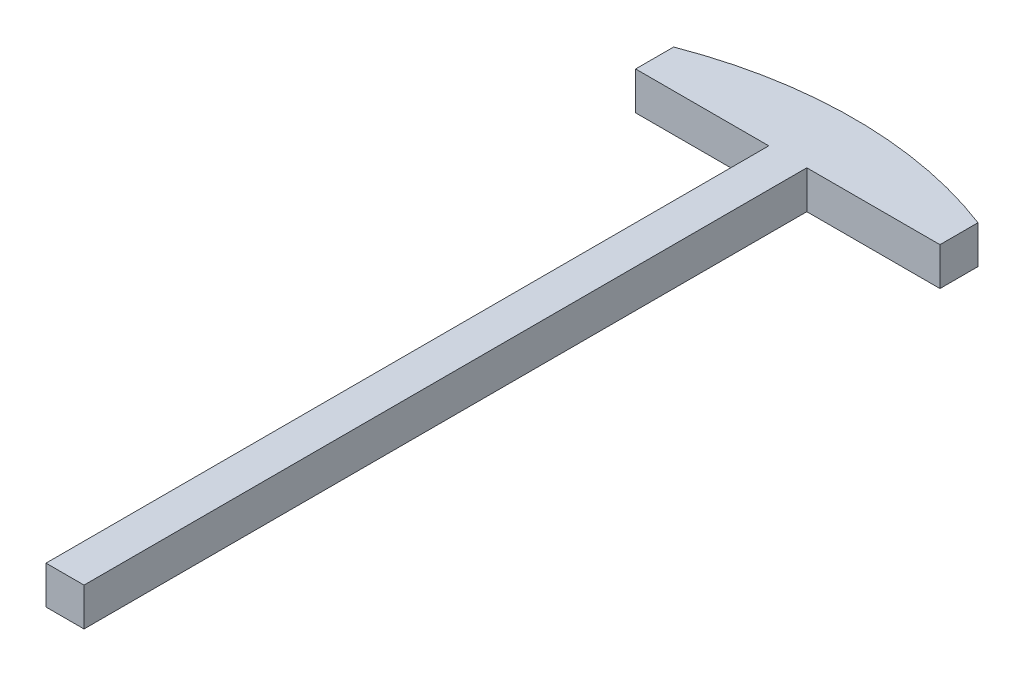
ISO-10303-21;
HEADER;
FILE_DESCRIPTION(('STEP AP214'),'2;1');
FILE_NAME('part.step','',(''),(''),'','','');
FILE_SCHEMA(('AUTOMOTIVE_DESIGN { 1 0 10303 214 1 1 1 1 }'));
ENDSEC;
DATA;
#1=APPLICATION_CONTEXT('core data for automotive mechanical design processes');
#2=APPLICATION_PROTOCOL_DEFINITION('international standard','automotive_design',2000,#1);
#3=PRODUCT_CONTEXT('',#1,'mechanical');
#4=PRODUCT('Part','Part','',(#3));
#5=PRODUCT_RELATED_PRODUCT_CATEGORY('part','',(#4));
#6=PRODUCT_DEFINITION_FORMATION('','',#4);
#7=PRODUCT_DEFINITION_CONTEXT('part definition',#1,'design');
#8=PRODUCT_DEFINITION('design','',#6,#7);
#9=PRODUCT_DEFINITION_SHAPE('','',#8);
#10=(LENGTH_UNIT() NAMED_UNIT(*) SI_UNIT(.MILLI.,.METRE.));
#11=(NAMED_UNIT(*) PLANE_ANGLE_UNIT() SI_UNIT($,.RADIAN.));
#12=(NAMED_UNIT(*) SI_UNIT($,.STERADIAN.) SOLID_ANGLE_UNIT());
#13=UNCERTAINTY_MEASURE_WITH_UNIT(LENGTH_MEASURE(1.E-05),#10,'distance_accuracy_value','');
#14=(GEOMETRIC_REPRESENTATION_CONTEXT(3) GLOBAL_UNCERTAINTY_ASSIGNED_CONTEXT((#13)) GLOBAL_UNIT_ASSIGNED_CONTEXT((#10,
#11,#12)) REPRESENTATION_CONTEXT('',''));
#15=CARTESIAN_POINT('',(0.,0.,0.));
#16=DIRECTION('',(0.,0.,1.));
#17=DIRECTION('',(1.,0.,0.));
#18=AXIS2_PLACEMENT_3D('',#15,#16,#17);
#19=CARTESIAN_POINT('',(2.31890353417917,5.,88.8094360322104));
#20=DIRECTION('',(-1.,0.,0.));
#21=DIRECTION('',(0.,0.,1.));
#22=AXIS2_PLACEMENT_3D('',#19,#20,#21);
#23=PLANE('',#22);
#24=DIRECTION('',(0.,0.,-1.));
#25=VECTOR('',#24,1.);
#26=CARTESIAN_POINT('',(2.31890353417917,0.,88.8094360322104));
#27=LINE('',#26,#25);
#28=CARTESIAN_POINT('',(2.31890353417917,0.,88.8094360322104));
#29=VERTEX_POINT('',#28);
#30=CARTESIAN_POINT('',(2.31890353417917,0.,-6.1905639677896));
#31=VERTEX_POINT('',#30);
#32=EDGE_CURVE('E128',#29,#31,#27,.T.);
#33=ORIENTED_EDGE('',*,*,#32,.T.);
#34=DIRECTION('',(0.,-1.,0.));
#35=VECTOR('',#34,1.);
#36=CARTESIAN_POINT('',(2.31890353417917,5.,-6.1905639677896));
#37=LINE('',#36,#35);
#38=CARTESIAN_POINT('',(2.31890353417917,5.,-6.1905639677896));
#39=VERTEX_POINT('',#38);
#40=EDGE_CURVE('E11',#39,#31,#37,.T.);
#41=ORIENTED_EDGE('',*,*,#40,.F.);
#42=DIRECTION('',(0.,0.,-1.));
#43=VECTOR('',#42,1.);
#44=CARTESIAN_POINT('',(2.31890353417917,5.,88.8094360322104));
#45=LINE('',#44,#43);
#46=CARTESIAN_POINT('',(2.31890353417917,5.,88.8094360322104));
#47=VERTEX_POINT('',#46);
#48=EDGE_CURVE('E142',#47,#39,#45,.T.);
#49=ORIENTED_EDGE('',*,*,#48,.F.);
#50=DIRECTION('',(0.,-1.,0.));
#51=VECTOR('',#50,1.);
#52=CARTESIAN_POINT('',(2.31890353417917,5.,88.8094360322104));
#53=LINE('',#52,#51);
#54=EDGE_CURVE('E124',#47,#29,#53,.T.);
#55=ORIENTED_EDGE('',*,*,#54,.T.);
#56=EDGE_LOOP('',(#33,#41,#49,#55));
#57=FACE_BOUND('',#56,.T.);
#58=ADVANCED_FACE('F32',(#57),#23,.F.);
#59=CARTESIAN_POINT('',(2.31890353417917,5.,-6.1905639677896));
#60=DIRECTION('',(0.,0.,-1.));
#61=DIRECTION('',(-1.,0.,0.));
#62=AXIS2_PLACEMENT_3D('',#59,#60,#61);
#63=PLANE('',#62);
#64=DIRECTION('',(1.,0.,0.));
#65=VECTOR('',#64,1.);
#66=CARTESIAN_POINT('',(2.31890353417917,0.,-6.1905639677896));
#67=LINE('',#66,#65);
#68=CARTESIAN_POINT('',(19.8189035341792,0.,-6.1905639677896));
#69=VERTEX_POINT('',#68);
#70=EDGE_CURVE('E131',#31,#69,#67,.T.);
#71=ORIENTED_EDGE('',*,*,#70,.T.);
#72=DIRECTION('',(0.,-1.,0.));
#73=VECTOR('',#72,1.);
#74=CARTESIAN_POINT('',(19.8189035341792,5.,-6.1905639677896));
#75=LINE('',#74,#73);
#76=CARTESIAN_POINT('',(19.8189035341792,5.,-6.1905639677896));
#77=VERTEX_POINT('',#76);
#78=EDGE_CURVE('E40',#77,#69,#75,.T.);
#79=ORIENTED_EDGE('',*,*,#78,.F.);
#80=DIRECTION('',(1.,0.,0.));
#81=VECTOR('',#80,1.);
#82=CARTESIAN_POINT('',(2.31890353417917,5.,-6.1905639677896));
#83=LINE('',#82,#81);
#84=EDGE_CURVE('E91',#39,#77,#83,.T.);
#85=ORIENTED_EDGE('',*,*,#84,.F.);
#86=ORIENTED_EDGE('',*,*,#40,.T.);
#87=EDGE_LOOP('',(#71,#79,#85,#86));
#88=FACE_BOUND('',#87,.T.);
#89=ADVANCED_FACE('F177',(#88),#63,.F.);
#90=CARTESIAN_POINT('',(19.8189035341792,5.,-6.1905639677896));
#91=DIRECTION('',(-1.,0.,0.));
#92=DIRECTION('',(0.,0.,1.));
#93=AXIS2_PLACEMENT_3D('',#90,#91,#92);
#94=PLANE('',#93);
#95=DIRECTION('',(0.,0.,-1.));
#96=VECTOR('',#95,1.);
#97=CARTESIAN_POINT('',(19.8189035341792,0.,-6.1905639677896));
#98=LINE('',#97,#96);
#99=CARTESIAN_POINT('',(19.8189035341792,0.,-11.1905639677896));
#100=VERTEX_POINT('',#99);
#101=EDGE_CURVE('E133',#69,#100,#98,.T.);
#102=ORIENTED_EDGE('',*,*,#101,.T.);
#103=DIRECTION('',(0.,-1.,0.));
#104=VECTOR('',#103,1.);
#105=CARTESIAN_POINT('',(19.8189035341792,5.,-11.1905639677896));
#106=LINE('',#105,#104);
#107=CARTESIAN_POINT('',(19.8189035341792,5.,-11.1905639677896));
#108=VERTEX_POINT('',#107);
#109=EDGE_CURVE('E149',#108,#100,#106,.T.);
#110=ORIENTED_EDGE('',*,*,#109,.F.);
#111=DIRECTION('',(0.,0.,-1.));
#112=VECTOR('',#111,1.);
#113=CARTESIAN_POINT('',(19.8189035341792,5.,-6.1905639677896));
#114=LINE('',#113,#112);
#115=EDGE_CURVE('E157',#77,#108,#114,.T.);
#116=ORIENTED_EDGE('',*,*,#115,.F.);
#117=ORIENTED_EDGE('',*,*,#78,.T.);
#118=EDGE_LOOP('',(#102,#110,#116,#117));
#119=FACE_BOUND('',#118,.T.);
#120=ADVANCED_FACE('F155',(#119),#94,.F.);
#121=CARTESIAN_POINT('',(-0.181096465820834,5.,40.9216247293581));
#122=DIRECTION('',(0.,-1.,0.));
#123=DIRECTION('',(0.,0.,-1.));
#124=AXIS2_PLACEMENT_3D('',#121,#122,#123);
#125=CYLINDRICAL_SURFACE('',#124,55.8182784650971);
#126=CARTESIAN_POINT('',(-0.181096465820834,0.,40.9216247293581));
#127=DIRECTION('',(0.,1.,0.));
#128=DIRECTION('',(0.,0.,1.));
#129=AXIS2_PLACEMENT_3D('',#126,#127,#128);
#130=CIRCLE('',#129,55.8182784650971);
#131=CARTESIAN_POINT('',(-20.1810964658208,0.,-11.1905639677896));
#132=VERTEX_POINT('',#131);
#133=EDGE_CURVE('E135',#100,#132,#130,.T.);
#134=ORIENTED_EDGE('',*,*,#133,.T.);
#135=DIRECTION('',(0.,-1.,0.));
#136=VECTOR('',#135,1.);
#137=CARTESIAN_POINT('',(-20.1810964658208,5.,-11.1905639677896));
#138=LINE('',#137,#136);
#139=CARTESIAN_POINT('',(-20.1810964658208,5.,-11.1905639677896));
#140=VERTEX_POINT('',#139);
#141=EDGE_CURVE('E146',#140,#132,#138,.T.);
#142=ORIENTED_EDGE('',*,*,#141,.F.);
#143=CARTESIAN_POINT('',(-0.181096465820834,5.,40.9216247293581));
#144=DIRECTION('',(0.,1.,0.));
#145=DIRECTION('',(0.,0.,1.));
#146=AXIS2_PLACEMENT_3D('',#143,#144,#145);
#147=CIRCLE('',#146,55.8182784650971);
#148=EDGE_CURVE('E169',#108,#140,#147,.T.);
#149=ORIENTED_EDGE('',*,*,#148,.F.);
#150=ORIENTED_EDGE('',*,*,#109,.T.);
#151=EDGE_LOOP('',(#134,#142,#149,#150));
#152=FACE_BOUND('',#151,.T.);
#153=ADVANCED_FACE('F165',(#152),#125,.T.);
#154=CARTESIAN_POINT('',(-20.1810964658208,5.,-11.1905639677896));
#155=DIRECTION('',(1.,0.,0.));
#156=DIRECTION('',(0.,0.,-1.));
#157=AXIS2_PLACEMENT_3D('',#154,#155,#156);
#158=PLANE('',#157);
#159=DIRECTION('',(0.,0.,1.));
#160=VECTOR('',#159,1.);
#161=CARTESIAN_POINT('',(-20.1810964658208,0.,-11.1905639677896));
#162=LINE('',#161,#160);
#163=CARTESIAN_POINT('',(-20.1810964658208,0.,-6.19056396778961));
#164=VERTEX_POINT('',#163);
#165=EDGE_CURVE('E137',#132,#164,#162,.T.);
#166=ORIENTED_EDGE('',*,*,#165,.T.);
#167=DIRECTION('',(0.,-1.,0.));
#168=VECTOR('',#167,1.);
#169=CARTESIAN_POINT('',(-20.1810964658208,5.,-6.19056396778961));
#170=LINE('',#169,#168);
#171=CARTESIAN_POINT('',(-20.1810964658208,5.,-6.19056396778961));
#172=VERTEX_POINT('',#171);
#173=EDGE_CURVE('E119',#172,#164,#170,.T.);
#174=ORIENTED_EDGE('',*,*,#173,.F.);
#175=DIRECTION('',(0.,0.,1.));
#176=VECTOR('',#175,1.);
#177=CARTESIAN_POINT('',(-20.1810964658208,5.,-11.1905639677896));
#178=LINE('',#177,#176);
#179=EDGE_CURVE('E110',#140,#172,#178,.T.);
#180=ORIENTED_EDGE('',*,*,#179,.F.);
#181=ORIENTED_EDGE('',*,*,#141,.T.);
#182=EDGE_LOOP('',(#166,#174,#180,#181));
#183=FACE_BOUND('',#182,.T.);
#184=ADVANCED_FACE('F168',(#183),#158,.F.);
#185=CARTESIAN_POINT('',(-20.1810964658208,5.,-6.19056396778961));
#186=DIRECTION('',(0.,0.,-1.));
#187=DIRECTION('',(-1.,0.,0.));
#188=AXIS2_PLACEMENT_3D('',#185,#186,#187);
#189=PLANE('',#188);
#190=DIRECTION('',(1.,0.,0.));
#191=VECTOR('',#190,1.);
#192=CARTESIAN_POINT('',(-20.1810964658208,0.,-6.19056396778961));
#193=LINE('',#192,#191);
#194=CARTESIAN_POINT('',(-2.68109646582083,0.,-6.19056396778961));
#195=VERTEX_POINT('',#194);
#196=EDGE_CURVE('E118',#164,#195,#193,.T.);
#197=ORIENTED_EDGE('',*,*,#196,.T.);
#198=DIRECTION('',(0.,-1.,0.));
#199=VECTOR('',#198,1.);
#200=CARTESIAN_POINT('',(-2.68109646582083,5.,-6.19056396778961));
#201=LINE('',#200,#199);
#202=CARTESIAN_POINT('',(-2.68109646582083,5.,-6.19056396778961));
#203=VERTEX_POINT('',#202);
#204=EDGE_CURVE('E115',#203,#195,#201,.T.);
#205=ORIENTED_EDGE('',*,*,#204,.F.);
#206=DIRECTION('',(1.,0.,0.));
#207=VECTOR('',#206,1.);
#208=CARTESIAN_POINT('',(-20.1810964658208,5.,-6.19056396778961));
#209=LINE('',#208,#207);
#210=EDGE_CURVE('E104',#172,#203,#209,.T.);
#211=ORIENTED_EDGE('',*,*,#210,.F.);
#212=ORIENTED_EDGE('',*,*,#173,.T.);
#213=EDGE_LOOP('',(#197,#205,#211,#212));
#214=FACE_BOUND('',#213,.T.);
#215=ADVANCED_FACE('F116',(#214),#189,.F.);
#216=CARTESIAN_POINT('',(-2.68109646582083,5.,-6.19056396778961));
#217=DIRECTION('',(1.,0.,0.));
#218=DIRECTION('',(0.,0.,-1.));
#219=AXIS2_PLACEMENT_3D('',#216,#217,#218);
#220=PLANE('',#219);
#221=DIRECTION('',(0.,0.,1.));
#222=VECTOR('',#221,1.);
#223=CARTESIAN_POINT('',(-2.68109646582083,0.,-6.19056396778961));
#224=LINE('',#223,#222);
#225=CARTESIAN_POINT('',(-2.68109646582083,0.,88.8094360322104));
#226=VERTEX_POINT('',#225);
#227=EDGE_CURVE('E77',#195,#226,#224,.T.);
#228=ORIENTED_EDGE('',*,*,#227,.T.);
#229=DIRECTION('',(0.,-1.,0.));
#230=VECTOR('',#229,1.);
#231=CARTESIAN_POINT('',(-2.68109646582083,5.,88.8094360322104));
#232=LINE('',#231,#230);
#233=CARTESIAN_POINT('',(-2.68109646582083,5.,88.8094360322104));
#234=VERTEX_POINT('',#233);
#235=EDGE_CURVE('E120',#234,#226,#232,.T.);
#236=ORIENTED_EDGE('',*,*,#235,.F.);
#237=DIRECTION('',(0.,0.,1.));
#238=VECTOR('',#237,1.);
#239=CARTESIAN_POINT('',(-2.68109646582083,5.,-6.19056396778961));
#240=LINE('',#239,#238);
#241=EDGE_CURVE('E108',#203,#234,#240,.T.);
#242=ORIENTED_EDGE('',*,*,#241,.F.);
#243=ORIENTED_EDGE('',*,*,#204,.T.);
#244=EDGE_LOOP('',(#228,#236,#242,#243));
#245=FACE_BOUND('',#244,.T.);
#246=ADVANCED_FACE('F122',(#245),#220,.F.);
#247=CARTESIAN_POINT('',(-2.68109646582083,5.,88.8094360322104));
#248=DIRECTION('',(0.,0.,-1.));
#249=DIRECTION('',(-1.,0.,0.));
#250=AXIS2_PLACEMENT_3D('',#247,#248,#249);
#251=PLANE('',#250);
#252=DIRECTION('',(1.,0.,0.));
#253=VECTOR('',#252,1.);
#254=CARTESIAN_POINT('',(-2.68109646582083,0.,88.8094360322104));
#255=LINE('',#254,#253);
#256=EDGE_CURVE('E83',#226,#29,#255,.T.);
#257=ORIENTED_EDGE('',*,*,#256,.T.);
#258=ORIENTED_EDGE('',*,*,#54,.F.);
#259=DIRECTION('',(1.,0.,0.));
#260=VECTOR('',#259,1.);
#261=CARTESIAN_POINT('',(-2.68109646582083,5.,88.8094360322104));
#262=LINE('',#261,#260);
#263=EDGE_CURVE('E48',#234,#47,#262,.T.);
#264=ORIENTED_EDGE('',*,*,#263,.F.);
#265=ORIENTED_EDGE('',*,*,#235,.T.);
#266=EDGE_LOOP('',(#257,#258,#264,#265));
#267=FACE_BOUND('',#266,.T.);
#268=ADVANCED_FACE('F193',(#267),#251,.F.);
#269=CARTESIAN_POINT('',(-0.181096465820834,5.,40.9216247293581));
#270=DIRECTION('',(0.,1.,0.));
#271=DIRECTION('',(0.,0.,1.));
#272=AXIS2_PLACEMENT_3D('',#269,#270,#271);
#273=PLANE('',#272);
#274=ORIENTED_EDGE('',*,*,#48,.T.);
#275=ORIENTED_EDGE('',*,*,#84,.T.);
#276=ORIENTED_EDGE('',*,*,#115,.T.);
#277=ORIENTED_EDGE('',*,*,#148,.T.);
#278=ORIENTED_EDGE('',*,*,#179,.T.);
#279=ORIENTED_EDGE('',*,*,#210,.T.);
#280=ORIENTED_EDGE('',*,*,#241,.T.);
#281=ORIENTED_EDGE('',*,*,#263,.T.);
#282=EDGE_LOOP('',(#274,#275,#276,#277,#278,#279,#280,#281));
#283=FACE_BOUND('',#282,.T.);
#284=ADVANCED_FACE('F106',(#283),#273,.T.);
#285=CARTESIAN_POINT('',(-0.181096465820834,0.,40.9216247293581));
#286=DIRECTION('',(0.,1.,0.));
#287=DIRECTION('',(0.,0.,1.));
#288=AXIS2_PLACEMENT_3D('',#285,#286,#287);
#289=PLANE('',#288);
#290=ORIENTED_EDGE('',*,*,#32,.F.);
#291=ORIENTED_EDGE('',*,*,#256,.F.);
#292=ORIENTED_EDGE('',*,*,#227,.F.);
#293=ORIENTED_EDGE('',*,*,#196,.F.);
#294=ORIENTED_EDGE('',*,*,#165,.F.);
#295=ORIENTED_EDGE('',*,*,#133,.F.);
#296=ORIENTED_EDGE('',*,*,#101,.F.);
#297=ORIENTED_EDGE('',*,*,#70,.F.);
#298=EDGE_LOOP('',(#290,#291,#292,#293,#294,#295,#296,#297));
#299=FACE_BOUND('',#298,.T.);
#300=ADVANCED_FACE('F161',(#299),#289,.F.);
#301=CLOSED_SHELL('',(#58,#89,#120,#153,#184,#215,#246,#268,#284,#300));
#302=MANIFOLD_SOLID_BREP('B2',#301);
#303=ADVANCED_BREP_SHAPE_REPRESENTATION('',(#18,#302),#14);
#304=SHAPE_DEFINITION_REPRESENTATION(#9,#303);
ENDSEC;
END-ISO-10303-21;
